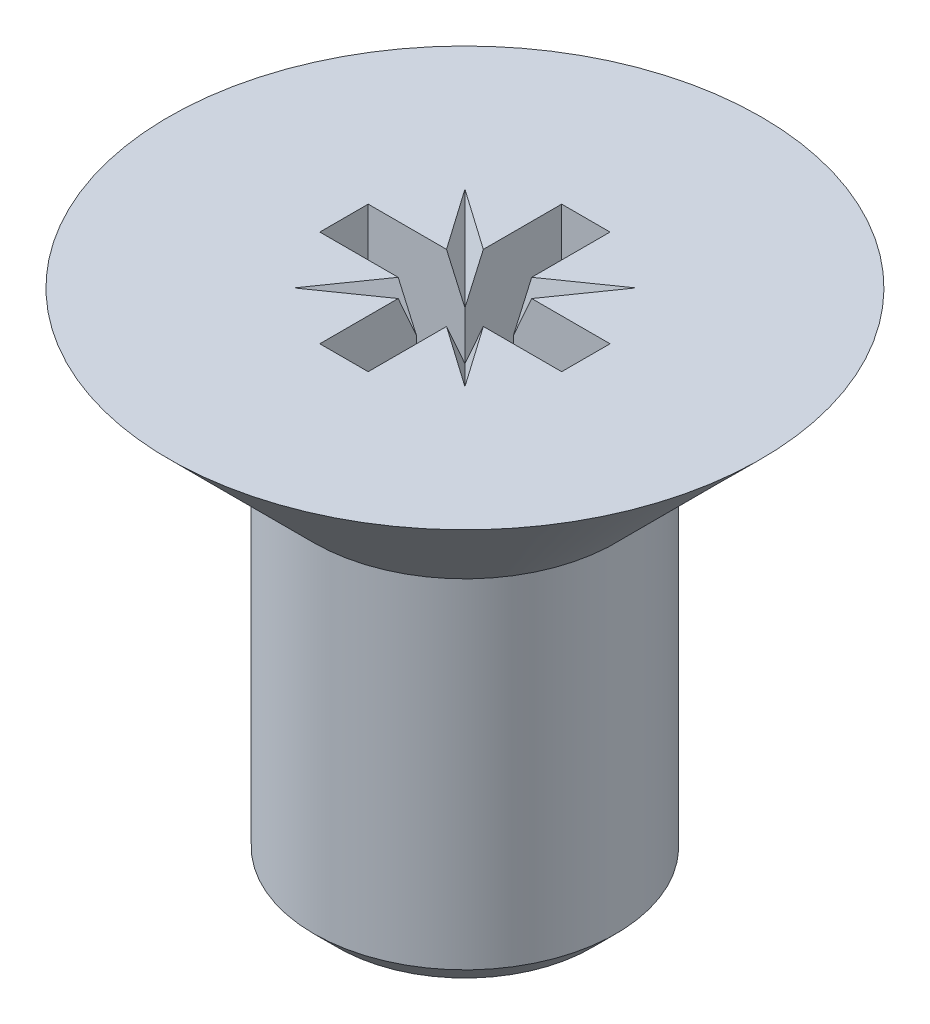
ISO-10303-21;
HEADER;
FILE_DESCRIPTION(('STEP AP214'),'2;1');
FILE_NAME('part.step','',(''),(''),'','','');
FILE_SCHEMA(('AUTOMOTIVE_DESIGN { 1 0 10303 214 1 1 1 1 }'));
ENDSEC;
DATA;
#1=APPLICATION_CONTEXT('core data for automotive mechanical design processes');
#2=APPLICATION_PROTOCOL_DEFINITION('international standard','automotive_design',2000,#1);
#3=PRODUCT_CONTEXT('',#1,'mechanical');
#4=PRODUCT('Part','Part','',(#3));
#5=PRODUCT_RELATED_PRODUCT_CATEGORY('part','',(#4));
#6=PRODUCT_DEFINITION_FORMATION('','',#4);
#7=PRODUCT_DEFINITION_CONTEXT('part definition',#1,'design');
#8=PRODUCT_DEFINITION('design','',#6,#7);
#9=PRODUCT_DEFINITION_SHAPE('','',#8);
#10=(LENGTH_UNIT() NAMED_UNIT(*) SI_UNIT(.MILLI.,.METRE.));
#11=(NAMED_UNIT(*) PLANE_ANGLE_UNIT() SI_UNIT($,.RADIAN.));
#12=(NAMED_UNIT(*) SI_UNIT($,.STERADIAN.) SOLID_ANGLE_UNIT());
#13=UNCERTAINTY_MEASURE_WITH_UNIT(LENGTH_MEASURE(1.E-05),#10,'distance_accuracy_value','');
#14=(GEOMETRIC_REPRESENTATION_CONTEXT(3) GLOBAL_UNCERTAINTY_ASSIGNED_CONTEXT((#13)) GLOBAL_UNIT_ASSIGNED_CONTEXT((#10,
#11,#12)) REPRESENTATION_CONTEXT('',''));
#15=CARTESIAN_POINT('',(0.,0.,0.));
#16=DIRECTION('',(0.,0.,1.));
#17=DIRECTION('',(1.,0.,0.));
#18=AXIS2_PLACEMENT_3D('',#15,#16,#17);
#19=CARTESIAN_POINT('',(0.,1.2,0.));
#20=DIRECTION('',(0.,1.,0.));
#21=DIRECTION('',(0.,0.,1.));
#22=AXIS2_PLACEMENT_3D('',#19,#20,#21);
#23=CONICAL_SURFACE('',#22,2.45,0.78539816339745);
#24=CARTESIAN_POINT('',(0.,0.,0.));
#25=DIRECTION('',(0.,-1.,0.));
#26=DIRECTION('',(0.,0.,-1.));
#27=AXIS2_PLACEMENT_3D('',#24,#25,#26);
#28=CIRCLE('',#27,1.25);
#29=CARTESIAN_POINT('',(0.,0.,-1.25));
#30=VERTEX_POINT('',#29);
#31=EDGE_CURVE('E311',#30,#30,#28,.T.);
#32=ORIENTED_EDGE('',*,*,#31,.F.);
#33=EDGE_LOOP('',(#32));
#34=FACE_BOUND('',#33,.T.);
#35=CARTESIAN_POINT('',(0.,1.2,0.));
#36=DIRECTION('',(0.,-1.,0.));
#37=DIRECTION('',(0.,0.,-1.));
#38=AXIS2_PLACEMENT_3D('',#35,#36,#37);
#39=CIRCLE('',#38,2.45);
#40=CARTESIAN_POINT('',(0.,1.2,-2.45));
#41=VERTEX_POINT('',#40);
#42=EDGE_CURVE('E279',#41,#41,#39,.T.);
#43=ORIENTED_EDGE('',*,*,#42,.T.);
#44=EDGE_LOOP('',(#43));
#45=FACE_BOUND('',#44,.T.);
#46=ADVANCED_FACE('F36',(#34,#45),#23,.T.);
#47=CARTESIAN_POINT('',(-2.45,1.2,0.));
#48=DIRECTION('',(0.,-1.,0.));
#49=DIRECTION('',(0.,0.,-1.));
#50=AXIS2_PLACEMENT_3D('',#47,#48,#49);
#51=PLANE('',#50);
#52=DIRECTION('',(0.,0.,1.));
#53=VECTOR('',#52,1.);
#54=CARTESIAN_POINT('',(-0.2,1.2,1.));
#55=LINE('',#54,#53);
#56=CARTESIAN_POINT('',(-0.2,1.2,0.352132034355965));
#57=VERTEX_POINT('',#56);
#58=CARTESIAN_POINT('',(-0.2,1.2,1.));
#59=VERTEX_POINT('',#58);
#60=EDGE_CURVE('E231',#57,#59,#55,.T.);
#61=ORIENTED_EDGE('',*,*,#60,.F.);
#62=DIRECTION('',(0.819231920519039,0.,-0.57346234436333));
#63=VECTOR('',#62,1.);
#64=CARTESIAN_POINT('',(-0.707106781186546,1.2,0.707106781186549));
#65=LINE('',#64,#63);
#66=CARTESIAN_POINT('',(-0.707106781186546,1.2,0.707106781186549));
#67=VERTEX_POINT('',#66);
#68=EDGE_CURVE('E174',#67,#57,#65,.T.);
#69=ORIENTED_EDGE('',*,*,#68,.F.);
#70=DIRECTION('',(-0.573462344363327,0.,0.819231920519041));
#71=VECTOR('',#70,1.);
#72=CARTESIAN_POINT('',(-0.707106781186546,1.2,0.707106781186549));
#73=LINE('',#72,#71);
#74=CARTESIAN_POINT('',(-0.352132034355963,1.2,0.2));
#75=VERTEX_POINT('',#74);
#76=EDGE_CURVE('E165',#75,#67,#73,.T.);
#77=ORIENTED_EDGE('',*,*,#76,.F.);
#78=DIRECTION('',(1.,0.,0.));
#79=VECTOR('',#78,1.);
#80=CARTESIAN_POINT('',(-0.2,1.2,0.2));
#81=LINE('',#80,#79);
#82=CARTESIAN_POINT('',(-1.,1.2,0.2));
#83=VERTEX_POINT('',#82);
#84=EDGE_CURVE('E228',#83,#75,#81,.T.);
#85=ORIENTED_EDGE('',*,*,#84,.F.);
#86=DIRECTION('',(0.,0.,1.));
#87=VECTOR('',#86,1.);
#88=CARTESIAN_POINT('',(-1.,1.2,-0.2));
#89=LINE('',#88,#87);
#90=CARTESIAN_POINT('',(-1.,1.2,-0.2));
#91=VERTEX_POINT('',#90);
#92=EDGE_CURVE('E225',#91,#83,#89,.T.);
#93=ORIENTED_EDGE('',*,*,#92,.F.);
#94=DIRECTION('',(-1.,0.,0.));
#95=VECTOR('',#94,1.);
#96=CARTESIAN_POINT('',(-0.2,1.2,-0.2));
#97=LINE('',#96,#95);
#98=CARTESIAN_POINT('',(-0.352132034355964,1.2,-0.2));
#99=VERTEX_POINT('',#98);
#100=EDGE_CURVE('E223',#99,#91,#97,.T.);
#101=ORIENTED_EDGE('',*,*,#100,.F.);
#102=DIRECTION('',(0.57346234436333,0.,0.81923192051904));
#103=VECTOR('',#102,1.);
#104=CARTESIAN_POINT('',(-0.707106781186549,1.2,-0.707106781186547));
#105=LINE('',#104,#103);
#106=CARTESIAN_POINT('',(-0.707106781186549,1.2,-0.707106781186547));
#107=VERTEX_POINT('',#106);
#108=EDGE_CURVE('E193',#107,#99,#105,.T.);
#109=ORIENTED_EDGE('',*,*,#108,.F.);
#110=DIRECTION('',(-0.819231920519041,0.,-0.573462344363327));
#111=VECTOR('',#110,1.);
#112=CARTESIAN_POINT('',(-0.707106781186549,1.2,-0.707106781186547));
#113=LINE('',#112,#111);
#114=CARTESIAN_POINT('',(-0.2,1.2,-0.352132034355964));
#115=VERTEX_POINT('',#114);
#116=EDGE_CURVE('E190',#115,#107,#113,.T.);
#117=ORIENTED_EDGE('',*,*,#116,.F.);
#118=DIRECTION('',(0.,0.,1.));
#119=VECTOR('',#118,1.);
#120=CARTESIAN_POINT('',(-0.2,1.2,-0.2));
#121=LINE('',#120,#119);
#122=CARTESIAN_POINT('',(-0.2,1.2,-1.));
#123=VERTEX_POINT('',#122);
#124=EDGE_CURVE('E220',#123,#115,#121,.T.);
#125=ORIENTED_EDGE('',*,*,#124,.F.);
#126=DIRECTION('',(-1.,0.,0.));
#127=VECTOR('',#126,1.);
#128=CARTESIAN_POINT('',(0.2,1.2,-1.));
#129=LINE('',#128,#127);
#130=CARTESIAN_POINT('',(0.2,1.2,-1.));
#131=VERTEX_POINT('',#130);
#132=EDGE_CURVE('E217',#131,#123,#129,.T.);
#133=ORIENTED_EDGE('',*,*,#132,.F.);
#134=DIRECTION('',(0.,0.,-1.));
#135=VECTOR('',#134,1.);
#136=CARTESIAN_POINT('',(0.2,1.2,-0.2));
#137=LINE('',#136,#135);
#138=CARTESIAN_POINT('',(0.2,1.2,-0.352132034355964));
#139=VERTEX_POINT('',#138);
#140=EDGE_CURVE('E215',#139,#131,#137,.T.);
#141=ORIENTED_EDGE('',*,*,#140,.F.);
#142=DIRECTION('',(-0.819231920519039,0.,0.573462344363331));
#143=VECTOR('',#142,1.);
#144=CARTESIAN_POINT('',(0.707106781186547,1.2,-0.707106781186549));
#145=LINE('',#144,#143);
#146=CARTESIAN_POINT('',(0.707106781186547,1.2,-0.707106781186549));
#147=VERTEX_POINT('',#146);
#148=EDGE_CURVE('E185',#147,#139,#145,.T.);
#149=ORIENTED_EDGE('',*,*,#148,.F.);
#150=DIRECTION('',(0.573462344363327,0.,-0.819231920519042));
#151=VECTOR('',#150,1.);
#152=CARTESIAN_POINT('',(0.707106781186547,1.2,-0.707106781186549));
#153=LINE('',#152,#151);
#154=CARTESIAN_POINT('',(0.352132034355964,1.2,-0.2));
#155=VERTEX_POINT('',#154);
#156=EDGE_CURVE('E182',#155,#147,#153,.T.);
#157=ORIENTED_EDGE('',*,*,#156,.F.);
#158=DIRECTION('',(-1.,0.,0.));
#159=VECTOR('',#158,1.);
#160=CARTESIAN_POINT('',(1.,1.2,-0.2));
#161=LINE('',#160,#159);
#162=CARTESIAN_POINT('',(1.,1.2,-0.2));
#163=VERTEX_POINT('',#162);
#164=EDGE_CURVE('E212',#163,#155,#161,.T.);
#165=ORIENTED_EDGE('',*,*,#164,.F.);
#166=DIRECTION('',(0.,0.,-1.));
#167=VECTOR('',#166,1.);
#168=CARTESIAN_POINT('',(1.,1.2,-0.2));
#169=LINE('',#168,#167);
#170=CARTESIAN_POINT('',(1.,1.2,0.2));
#171=VERTEX_POINT('',#170);
#172=EDGE_CURVE('E210',#171,#163,#169,.T.);
#173=ORIENTED_EDGE('',*,*,#172,.F.);
#174=DIRECTION('',(1.,0.,0.));
#175=VECTOR('',#174,1.);
#176=CARTESIAN_POINT('',(1.,1.2,0.2));
#177=LINE('',#176,#175);
#178=CARTESIAN_POINT('',(0.352132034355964,1.2,0.2));
#179=VERTEX_POINT('',#178);
#180=EDGE_CURVE('E181',#179,#171,#177,.T.);
#181=ORIENTED_EDGE('',*,*,#180,.F.);
#182=DIRECTION('',(-0.573462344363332,0.,-0.819231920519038));
#183=VECTOR('',#182,1.);
#184=CARTESIAN_POINT('',(0.707106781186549,1.2,0.707106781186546));
#185=LINE('',#184,#183);
#186=CARTESIAN_POINT('',(0.707106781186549,1.2,0.707106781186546));
#187=VERTEX_POINT('',#186);
#188=EDGE_CURVE('E160',#187,#179,#185,.T.);
#189=ORIENTED_EDGE('',*,*,#188,.F.);
#190=DIRECTION('',(0.819231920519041,0.,0.573462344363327));
#191=VECTOR('',#190,1.);
#192=CARTESIAN_POINT('',(0.707106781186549,1.2,0.707106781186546));
#193=LINE('',#192,#191);
#194=CARTESIAN_POINT('',(0.2,1.2,0.352132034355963));
#195=VERTEX_POINT('',#194);
#196=EDGE_CURVE('E168',#195,#187,#193,.T.);
#197=ORIENTED_EDGE('',*,*,#196,.F.);
#198=DIRECTION('',(0.,0.,-1.));
#199=VECTOR('',#198,1.);
#200=CARTESIAN_POINT('',(0.2,1.2,1.));
#201=LINE('',#200,#199);
#202=CARTESIAN_POINT('',(0.2,1.2,1.));
#203=VERTEX_POINT('',#202);
#204=EDGE_CURVE('E236',#203,#195,#201,.T.);
#205=ORIENTED_EDGE('',*,*,#204,.F.);
#206=DIRECTION('',(1.,0.,0.));
#207=VECTOR('',#206,1.);
#208=CARTESIAN_POINT('',(0.2,1.2,1.));
#209=LINE('',#208,#207);
#210=EDGE_CURVE('E233',#59,#203,#209,.T.);
#211=ORIENTED_EDGE('',*,*,#210,.F.);
#212=EDGE_LOOP('',(#61,#69,#77,#85,#93,#101,#109,#117,#125,#133,#141,#149,#157,#165,#173,#181,
#189,#197,#205,#211));
#213=FACE_BOUND('',#212,.T.);
#214=ORIENTED_EDGE('',*,*,#42,.F.);
#215=EDGE_LOOP('',(#214));
#216=FACE_BOUND('',#215,.T.);
#217=ADVANCED_FACE('F178',(#213,#216),#51,.F.);
#218=CARTESIAN_POINT('',(0.,-3.,0.));
#219=DIRECTION('',(0.,1.,0.));
#220=DIRECTION('',(0.,0.,1.));
#221=AXIS2_PLACEMENT_3D('',#218,#219,#220);
#222=CYLINDRICAL_SURFACE('',#221,1.25);
#223=CARTESIAN_POINT('',(0.,-2.8,0.));
#224=DIRECTION('',(0.,-1.,0.));
#225=DIRECTION('',(0.,0.,-1.));
#226=AXIS2_PLACEMENT_3D('',#223,#224,#225);
#227=CIRCLE('',#226,1.25);
#228=CARTESIAN_POINT('',(0.,-2.8,-1.25));
#229=VERTEX_POINT('',#228);
#230=EDGE_CURVE('E11',#229,#229,#227,.F.);
#231=ORIENTED_EDGE('',*,*,#230,.T.);
#232=EDGE_LOOP('',(#231));
#233=FACE_BOUND('',#232,.T.);
#234=ORIENTED_EDGE('',*,*,#31,.T.);
#235=EDGE_LOOP('',(#234));
#236=FACE_BOUND('',#235,.T.);
#237=ADVANCED_FACE('F343',(#233,#236),#222,.T.);
#238=CARTESIAN_POINT('',(0.,-3.,0.));
#239=DIRECTION('',(0.,-1.,0.));
#240=DIRECTION('',(0.,0.,-1.));
#241=AXIS2_PLACEMENT_3D('',#238,#239,#240);
#242=PLANE('',#241);
#243=CARTESIAN_POINT('',(0.,-3.,0.));
#244=DIRECTION('',(0.,-1.,0.));
#245=DIRECTION('',(0.,0.,-1.));
#246=AXIS2_PLACEMENT_3D('',#243,#244,#245);
#247=CIRCLE('',#246,1.05);
#248=CARTESIAN_POINT('',(0.,-3.,-1.05));
#249=VERTEX_POINT('',#248);
#250=EDGE_CURVE('E43',#249,#249,#247,.T.);
#251=ORIENTED_EDGE('',*,*,#250,.T.);
#252=EDGE_LOOP('',(#251));
#253=FACE_BOUND('',#252,.T.);
#254=ADVANCED_FACE('F326',(#253),#242,.T.);
#255=CARTESIAN_POINT('',(1.,0.4,-0.2));
#256=DIRECTION('',(1.,0.,0.));
#257=DIRECTION('',(0.,0.,-1.));
#258=AXIS2_PLACEMENT_3D('',#255,#256,#257);
#259=PLANE('',#258);
#260=ORIENTED_EDGE('',*,*,#172,.T.);
#261=DIRECTION('',(0.,1.,0.));
#262=VECTOR('',#261,1.);
#263=CARTESIAN_POINT('',(1.,0.4,-0.2));
#264=LINE('',#263,#262);
#265=CARTESIAN_POINT('',(1.,0.4,-0.2));
#266=VERTEX_POINT('',#265);
#267=EDGE_CURVE('E275',#266,#163,#264,.T.);
#268=ORIENTED_EDGE('',*,*,#267,.F.);
#269=DIRECTION('',(0.,0.,-1.));
#270=VECTOR('',#269,1.);
#271=CARTESIAN_POINT('',(1.,0.4,-0.2));
#272=LINE('',#271,#270);
#273=CARTESIAN_POINT('',(1.,0.4,0.2));
#274=VERTEX_POINT('',#273);
#275=EDGE_CURVE('E239',#274,#266,#272,.T.);
#276=ORIENTED_EDGE('',*,*,#275,.F.);
#277=DIRECTION('',(0.,1.,0.));
#278=VECTOR('',#277,1.);
#279=CARTESIAN_POINT('',(1.,0.4,0.2));
#280=LINE('',#279,#278);
#281=EDGE_CURVE('E276',#274,#171,#280,.T.);
#282=ORIENTED_EDGE('',*,*,#281,.T.);
#283=EDGE_LOOP('',(#260,#268,#276,#282));
#284=FACE_BOUND('',#283,.T.);
#285=ADVANCED_FACE('F354',(#284),#259,.F.);
#286=CARTESIAN_POINT('',(1.,0.4,0.2));
#287=DIRECTION('',(0.,0.,1.));
#288=DIRECTION('',(1.,0.,0.));
#289=AXIS2_PLACEMENT_3D('',#286,#287,#288);
#290=PLANE('',#289);
#291=DIRECTION('',(0.,1.,0.));
#292=VECTOR('',#291,1.);
#293=CARTESIAN_POINT('',(0.2,0.4,0.2));
#294=LINE('',#293,#292);
#295=CARTESIAN_POINT('',(0.2,0.4,0.2));
#296=VERTEX_POINT('',#295);
#297=CARTESIAN_POINT('',(0.2,0.857577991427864,0.2));
#298=VERTEX_POINT('',#297);
#299=EDGE_CURVE('E280',#296,#298,#294,.T.);
#300=ORIENTED_EDGE('',*,*,#299,.T.);
#301=DIRECTION('',(0.406014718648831,0.9138665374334,0.));
#302=VECTOR('',#301,1.);
#303=CARTESIAN_POINT('',(0.162097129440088,0.772265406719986,0.2));
#304=LINE('',#303,#302);
#305=EDGE_CURVE('E162',#298,#179,#304,.T.);
#306=ORIENTED_EDGE('',*,*,#305,.T.);
#307=ORIENTED_EDGE('',*,*,#180,.T.);
#308=ORIENTED_EDGE('',*,*,#281,.F.);
#309=DIRECTION('',(1.,0.,0.));
#310=VECTOR('',#309,1.);
#311=CARTESIAN_POINT('',(1.,0.4,0.2));
#312=LINE('',#311,#310);
#313=EDGE_CURVE('E272',#296,#274,#312,.T.);
#314=ORIENTED_EDGE('',*,*,#313,.F.);
#315=EDGE_LOOP('',(#300,#306,#307,#308,#314));
#316=FACE_BOUND('',#315,.T.);
#317=ADVANCED_FACE('F359',(#316),#290,.F.);
#318=CARTESIAN_POINT('',(0.2,0.4,1.));
#319=DIRECTION('',(1.,0.,0.));
#320=DIRECTION('',(0.,0.,-1.));
#321=AXIS2_PLACEMENT_3D('',#318,#319,#320);
#322=PLANE('',#321);
#323=ORIENTED_EDGE('',*,*,#204,.T.);
#324=DIRECTION('',(0.,-0.9138665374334,-0.406014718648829));
#325=VECTOR('',#324,1.);
#326=CARTESIAN_POINT('',(0.2,0.772265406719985,0.162097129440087));
#327=LINE('',#326,#325);
#328=EDGE_CURVE('E170',#195,#298,#327,.T.);
#329=ORIENTED_EDGE('',*,*,#328,.T.);
#330=ORIENTED_EDGE('',*,*,#299,.F.);
#331=DIRECTION('',(0.,0.,-1.));
#332=VECTOR('',#331,1.);
#333=CARTESIAN_POINT('',(0.2,0.4,1.));
#334=LINE('',#333,#332);
#335=CARTESIAN_POINT('',(0.2,0.4,1.));
#336=VERTEX_POINT('',#335);
#337=EDGE_CURVE('E269',#336,#296,#334,.T.);
#338=ORIENTED_EDGE('',*,*,#337,.F.);
#339=DIRECTION('',(0.,1.,0.));
#340=VECTOR('',#339,1.);
#341=CARTESIAN_POINT('',(0.2,0.4,1.));
#342=LINE('',#341,#340);
#343=EDGE_CURVE('E283',#336,#203,#342,.T.);
#344=ORIENTED_EDGE('',*,*,#343,.T.);
#345=EDGE_LOOP('',(#323,#329,#330,#338,#344));
#346=FACE_BOUND('',#345,.T.);
#347=ADVANCED_FACE('F397',(#346),#322,.F.);
#348=CARTESIAN_POINT('',(0.2,0.4,1.));
#349=DIRECTION('',(0.,0.,1.));
#350=DIRECTION('',(1.,0.,0.));
#351=AXIS2_PLACEMENT_3D('',#348,#349,#350);
#352=PLANE('',#351);
#353=ORIENTED_EDGE('',*,*,#210,.T.);
#354=ORIENTED_EDGE('',*,*,#343,.F.);
#355=DIRECTION('',(1.,0.,0.));
#356=VECTOR('',#355,1.);
#357=CARTESIAN_POINT('',(0.2,0.4,1.));
#358=LINE('',#357,#356);
#359=CARTESIAN_POINT('',(-0.2,0.4,1.));
#360=VERTEX_POINT('',#359);
#361=EDGE_CURVE('E266',#360,#336,#358,.T.);
#362=ORIENTED_EDGE('',*,*,#361,.F.);
#363=DIRECTION('',(0.,1.,0.));
#364=VECTOR('',#363,1.);
#365=CARTESIAN_POINT('',(-0.2,0.4,1.));
#366=LINE('',#365,#364);
#367=EDGE_CURVE('E285',#360,#59,#366,.T.);
#368=ORIENTED_EDGE('',*,*,#367,.T.);
#369=EDGE_LOOP('',(#353,#354,#362,#368));
#370=FACE_BOUND('',#369,.T.);
#371=ADVANCED_FACE('F393',(#370),#352,.F.);
#372=CARTESIAN_POINT('',(-0.2,0.4,1.));
#373=DIRECTION('',(-1.,0.,0.));
#374=DIRECTION('',(0.,0.,1.));
#375=AXIS2_PLACEMENT_3D('',#372,#373,#374);
#376=PLANE('',#375);
#377=DIRECTION('',(0.,1.,0.));
#378=VECTOR('',#377,1.);
#379=CARTESIAN_POINT('',(-0.2,0.4,0.2));
#380=LINE('',#379,#378);
#381=CARTESIAN_POINT('',(-0.2,0.4,0.2));
#382=VERTEX_POINT('',#381);
#383=CARTESIAN_POINT('',(-0.2,0.857577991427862,0.2));
#384=VERTEX_POINT('',#383);
#385=EDGE_CURVE('E288',#382,#384,#380,.T.);
#386=ORIENTED_EDGE('',*,*,#385,.T.);
#387=DIRECTION('',(0.,0.9138665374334,0.40601471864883));
#388=VECTOR('',#387,1.);
#389=CARTESIAN_POINT('',(-0.2,0.772265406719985,0.162097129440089));
#390=LINE('',#389,#388);
#391=EDGE_CURVE('E206',#384,#57,#390,.T.);
#392=ORIENTED_EDGE('',*,*,#391,.T.);
#393=ORIENTED_EDGE('',*,*,#60,.T.);
#394=ORIENTED_EDGE('',*,*,#367,.F.);
#395=DIRECTION('',(0.,0.,1.));
#396=VECTOR('',#395,1.);
#397=CARTESIAN_POINT('',(-0.2,0.4,1.));
#398=LINE('',#397,#396);
#399=EDGE_CURVE('E263',#382,#360,#398,.T.);
#400=ORIENTED_EDGE('',*,*,#399,.F.);
#401=EDGE_LOOP('',(#386,#392,#393,#394,#400));
#402=FACE_BOUND('',#401,.T.);
#403=ADVANCED_FACE('F389',(#402),#376,.F.);
#404=CARTESIAN_POINT('',(-0.2,0.4,0.2));
#405=DIRECTION('',(0.,0.,1.));
#406=DIRECTION('',(1.,0.,0.));
#407=AXIS2_PLACEMENT_3D('',#404,#405,#406);
#408=PLANE('',#407);
#409=ORIENTED_EDGE('',*,*,#84,.T.);
#410=DIRECTION('',(0.406014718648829,-0.9138665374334,0.));
#411=VECTOR('',#410,1.);
#412=CARTESIAN_POINT('',(-0.0302187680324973,0.475430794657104,0.2));
#413=LINE('',#412,#411);
#414=EDGE_CURVE('E320',#75,#384,#413,.T.);
#415=ORIENTED_EDGE('',*,*,#414,.T.);
#416=ORIENTED_EDGE('',*,*,#385,.F.);
#417=DIRECTION('',(1.,0.,0.));
#418=VECTOR('',#417,1.);
#419=CARTESIAN_POINT('',(-0.2,0.4,0.2));
#420=LINE('',#419,#418);
#421=CARTESIAN_POINT('',(-1.,0.4,0.2));
#422=VERTEX_POINT('',#421);
#423=EDGE_CURVE('E260',#422,#382,#420,.T.);
#424=ORIENTED_EDGE('',*,*,#423,.F.);
#425=DIRECTION('',(0.,1.,0.));
#426=VECTOR('',#425,1.);
#427=CARTESIAN_POINT('',(-1.,0.4,0.2));
#428=LINE('',#427,#426);
#429=EDGE_CURVE('E291',#422,#83,#428,.T.);
#430=ORIENTED_EDGE('',*,*,#429,.T.);
#431=EDGE_LOOP('',(#409,#415,#416,#424,#430));
#432=FACE_BOUND('',#431,.T.);
#433=ADVANCED_FACE('F385',(#432),#408,.F.);
#434=CARTESIAN_POINT('',(-1.,0.4,-0.2));
#435=DIRECTION('',(-1.,0.,0.));
#436=DIRECTION('',(0.,0.,1.));
#437=AXIS2_PLACEMENT_3D('',#434,#435,#436);
#438=PLANE('',#437);
#439=ORIENTED_EDGE('',*,*,#92,.T.);
#440=ORIENTED_EDGE('',*,*,#429,.F.);
#441=DIRECTION('',(0.,0.,1.));
#442=VECTOR('',#441,1.);
#443=CARTESIAN_POINT('',(-1.,0.4,-0.2));
#444=LINE('',#443,#442);
#445=CARTESIAN_POINT('',(-1.,0.4,-0.2));
#446=VERTEX_POINT('',#445);
#447=EDGE_CURVE('E257',#446,#422,#444,.T.);
#448=ORIENTED_EDGE('',*,*,#447,.F.);
#449=DIRECTION('',(0.,1.,0.));
#450=VECTOR('',#449,1.);
#451=CARTESIAN_POINT('',(-1.,0.4,-0.2));
#452=LINE('',#451,#450);
#453=EDGE_CURVE('E293',#446,#91,#452,.T.);
#454=ORIENTED_EDGE('',*,*,#453,.T.);
#455=EDGE_LOOP('',(#439,#440,#448,#454));
#456=FACE_BOUND('',#455,.T.);
#457=ADVANCED_FACE('F381',(#456),#438,.F.);
#458=CARTESIAN_POINT('',(-0.2,0.4,-0.2));
#459=DIRECTION('',(0.,0.,-1.));
#460=DIRECTION('',(-1.,0.,0.));
#461=AXIS2_PLACEMENT_3D('',#458,#459,#460);
#462=PLANE('',#461);
#463=DIRECTION('',(0.,1.,0.));
#464=VECTOR('',#463,1.);
#465=CARTESIAN_POINT('',(-0.2,0.4,-0.2));
#466=LINE('',#465,#464);
#467=CARTESIAN_POINT('',(-0.2,0.4,-0.2));
#468=VERTEX_POINT('',#467);
#469=CARTESIAN_POINT('',(-0.2,0.857577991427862,-0.2));
#470=VERTEX_POINT('',#469);
#471=EDGE_CURVE('E296',#468,#470,#466,.T.);
#472=ORIENTED_EDGE('',*,*,#471,.T.);
#473=DIRECTION('',(-0.40601471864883,0.9138665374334,0.));
#474=VECTOR('',#473,1.);
#475=CARTESIAN_POINT('',(-0.0302187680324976,0.475430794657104,-0.2));
#476=LINE('',#475,#474);
#477=EDGE_CURVE('E203',#470,#99,#476,.T.);
#478=ORIENTED_EDGE('',*,*,#477,.T.);
#479=ORIENTED_EDGE('',*,*,#100,.T.);
#480=ORIENTED_EDGE('',*,*,#453,.F.);
#481=DIRECTION('',(-1.,0.,0.));
#482=VECTOR('',#481,1.);
#483=CARTESIAN_POINT('',(-0.2,0.4,-0.2));
#484=LINE('',#483,#482);
#485=EDGE_CURVE('E254',#468,#446,#484,.T.);
#486=ORIENTED_EDGE('',*,*,#485,.F.);
#487=EDGE_LOOP('',(#472,#478,#479,#480,#486));
#488=FACE_BOUND('',#487,.T.);
#489=ADVANCED_FACE('F377',(#488),#462,.F.);
#490=CARTESIAN_POINT('',(-0.2,0.4,-0.2));
#491=DIRECTION('',(-1.,0.,0.));
#492=DIRECTION('',(0.,0.,1.));
#493=AXIS2_PLACEMENT_3D('',#490,#491,#492);
#494=PLANE('',#493);
#495=ORIENTED_EDGE('',*,*,#124,.T.);
#496=DIRECTION('',(0.,-0.9138665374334,0.406014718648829));
#497=VECTOR('',#496,1.);
#498=CARTESIAN_POINT('',(-0.2,0.475430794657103,-0.0302187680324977));
#499=LINE('',#498,#497);
#500=EDGE_CURVE('E317',#115,#470,#499,.T.);
#501=ORIENTED_EDGE('',*,*,#500,.T.);
#502=ORIENTED_EDGE('',*,*,#471,.F.);
#503=DIRECTION('',(0.,0.,1.));
#504=VECTOR('',#503,1.);
#505=CARTESIAN_POINT('',(-0.2,0.4,-0.2));
#506=LINE('',#505,#504);
#507=CARTESIAN_POINT('',(-0.2,0.4,-1.));
#508=VERTEX_POINT('',#507);
#509=EDGE_CURVE('E251',#508,#468,#506,.T.);
#510=ORIENTED_EDGE('',*,*,#509,.F.);
#511=DIRECTION('',(0.,1.,0.));
#512=VECTOR('',#511,1.);
#513=CARTESIAN_POINT('',(-0.2,0.4,-1.));
#514=LINE('',#513,#512);
#515=EDGE_CURVE('E299',#508,#123,#514,.T.);
#516=ORIENTED_EDGE('',*,*,#515,.T.);
#517=EDGE_LOOP('',(#495,#501,#502,#510,#516));
#518=FACE_BOUND('',#517,.T.);
#519=ADVANCED_FACE('F373',(#518),#494,.F.);
#520=CARTESIAN_POINT('',(0.2,0.4,-1.));
#521=DIRECTION('',(0.,0.,-1.));
#522=DIRECTION('',(-1.,0.,0.));
#523=AXIS2_PLACEMENT_3D('',#520,#521,#522);
#524=PLANE('',#523);
#525=ORIENTED_EDGE('',*,*,#132,.T.);
#526=ORIENTED_EDGE('',*,*,#515,.F.);
#527=DIRECTION('',(-1.,0.,0.));
#528=VECTOR('',#527,1.);
#529=CARTESIAN_POINT('',(0.2,0.4,-1.));
#530=LINE('',#529,#528);
#531=CARTESIAN_POINT('',(0.2,0.4,-1.));
#532=VERTEX_POINT('',#531);
#533=EDGE_CURVE('E248',#532,#508,#530,.T.);
#534=ORIENTED_EDGE('',*,*,#533,.F.);
#535=DIRECTION('',(0.,1.,0.));
#536=VECTOR('',#535,1.);
#537=CARTESIAN_POINT('',(0.2,0.4,-1.));
#538=LINE('',#537,#536);
#539=EDGE_CURVE('E301',#532,#131,#538,.T.);
#540=ORIENTED_EDGE('',*,*,#539,.T.);
#541=EDGE_LOOP('',(#525,#526,#534,#540));
#542=FACE_BOUND('',#541,.T.);
#543=ADVANCED_FACE('F369',(#542),#524,.F.);
#544=CARTESIAN_POINT('',(0.2,0.4,-0.2));
#545=DIRECTION('',(1.,0.,0.));
#546=DIRECTION('',(0.,0.,-1.));
#547=AXIS2_PLACEMENT_3D('',#544,#545,#546);
#548=PLANE('',#547);
#549=DIRECTION('',(0.,1.,0.));
#550=VECTOR('',#549,1.);
#551=CARTESIAN_POINT('',(0.2,0.4,-0.2));
#552=LINE('',#551,#550);
#553=CARTESIAN_POINT('',(0.2,0.4,-0.2));
#554=VERTEX_POINT('',#553);
#555=CARTESIAN_POINT('',(0.2,0.857577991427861,-0.2));
#556=VERTEX_POINT('',#555);
#557=EDGE_CURVE('E304',#554,#556,#552,.T.);
#558=ORIENTED_EDGE('',*,*,#557,.T.);
#559=DIRECTION('',(0.,0.9138665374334,-0.40601471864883));
#560=VECTOR('',#559,1.);
#561=CARTESIAN_POINT('',(0.2,0.475430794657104,-0.0302187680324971));
#562=LINE('',#561,#560);
#563=EDGE_CURVE('E196',#556,#139,#562,.T.);
#564=ORIENTED_EDGE('',*,*,#563,.T.);
#565=ORIENTED_EDGE('',*,*,#140,.T.);
#566=ORIENTED_EDGE('',*,*,#539,.F.);
#567=DIRECTION('',(0.,0.,-1.));
#568=VECTOR('',#567,1.);
#569=CARTESIAN_POINT('',(0.2,0.4,-0.2));
#570=LINE('',#569,#568);
#571=EDGE_CURVE('E245',#554,#532,#570,.T.);
#572=ORIENTED_EDGE('',*,*,#571,.F.);
#573=EDGE_LOOP('',(#558,#564,#565,#566,#572));
#574=FACE_BOUND('',#573,.T.);
#575=ADVANCED_FACE('F365',(#574),#548,.F.);
#576=CARTESIAN_POINT('',(1.,0.4,-0.2));
#577=DIRECTION('',(0.,0.,-1.));
#578=DIRECTION('',(-1.,0.,0.));
#579=AXIS2_PLACEMENT_3D('',#576,#577,#578);
#580=PLANE('',#579);
#581=ORIENTED_EDGE('',*,*,#164,.T.);
#582=DIRECTION('',(-0.406014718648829,-0.9138665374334,0.));
#583=VECTOR('',#582,1.);
#584=CARTESIAN_POINT('',(0.162097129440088,0.772265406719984,-0.2));
#585=LINE('',#584,#583);
#586=EDGE_CURVE('E314',#155,#556,#585,.T.);
#587=ORIENTED_EDGE('',*,*,#586,.T.);
#588=ORIENTED_EDGE('',*,*,#557,.F.);
#589=DIRECTION('',(-1.,0.,0.));
#590=VECTOR('',#589,1.);
#591=CARTESIAN_POINT('',(1.,0.4,-0.2));
#592=LINE('',#591,#590);
#593=EDGE_CURVE('E242',#266,#554,#592,.T.);
#594=ORIENTED_EDGE('',*,*,#593,.F.);
#595=ORIENTED_EDGE('',*,*,#267,.T.);
#596=EDGE_LOOP('',(#581,#587,#588,#594,#595));
#597=FACE_BOUND('',#596,.T.);
#598=ADVANCED_FACE('F361',(#597),#580,.F.);
#599=CARTESIAN_POINT('',(1.,0.4,1.));
#600=DIRECTION('',(0.,-1.,0.));
#601=DIRECTION('',(0.,0.,-1.));
#602=AXIS2_PLACEMENT_3D('',#599,#600,#601);
#603=PLANE('',#602);
#604=ORIENTED_EDGE('',*,*,#275,.T.);
#605=ORIENTED_EDGE('',*,*,#593,.T.);
#606=ORIENTED_EDGE('',*,*,#571,.T.);
#607=ORIENTED_EDGE('',*,*,#533,.T.);
#608=ORIENTED_EDGE('',*,*,#509,.T.);
#609=ORIENTED_EDGE('',*,*,#485,.T.);
#610=ORIENTED_EDGE('',*,*,#447,.T.);
#611=ORIENTED_EDGE('',*,*,#423,.T.);
#612=ORIENTED_EDGE('',*,*,#399,.T.);
#613=ORIENTED_EDGE('',*,*,#361,.T.);
#614=ORIENTED_EDGE('',*,*,#337,.T.);
#615=ORIENTED_EDGE('',*,*,#313,.T.);
#616=EDGE_LOOP('',(#604,#605,#606,#607,#608,#609,#610,#611,#612,#613,#614,#615));
#617=FACE_BOUND('',#616,.T.);
#618=ADVANCED_FACE('F364',(#617),#603,.F.);
#619=CARTESIAN_POINT('',(0.707106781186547,1.2,-0.707106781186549));
#620=DIRECTION('',(0.769826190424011,-0.342020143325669,0.538878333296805));
#621=DIRECTION('',(0.573462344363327,0.,-0.819231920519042));
#622=AXIS2_PLACEMENT_3D('',#619,#620,#621);
#623=PLANE('',#622);
#624=ORIENTED_EDGE('',*,*,#156,.T.);
#625=DIRECTION('',(0.638101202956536,0.430875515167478,-0.638101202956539));
#626=VECTOR('',#625,1.);
#627=CARTESIAN_POINT('',(0.707106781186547,1.2,-0.707106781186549));
#628=LINE('',#627,#626);
#629=EDGE_CURVE('E164',#556,#147,#628,.T.);
#630=ORIENTED_EDGE('',*,*,#629,.F.);
#631=ORIENTED_EDGE('',*,*,#586,.F.);
#632=EDGE_LOOP('',(#624,#630,#631));
#633=FACE_BOUND('',#632,.T.);
#634=ADVANCED_FACE('F407',(#633),#623,.F.);
#635=CARTESIAN_POINT('',(0.707106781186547,1.2,-0.707106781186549));
#636=DIRECTION('',(-0.538878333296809,-0.342020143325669,-0.769826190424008));
#637=DIRECTION('',(-0.819231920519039,0.,0.573462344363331));
#638=AXIS2_PLACEMENT_3D('',#635,#636,#637);
#639=PLANE('',#638);
#640=ORIENTED_EDGE('',*,*,#629,.T.);
#641=ORIENTED_EDGE('',*,*,#148,.T.);
#642=ORIENTED_EDGE('',*,*,#563,.F.);
#643=EDGE_LOOP('',(#640,#641,#642));
#644=FACE_BOUND('',#643,.T.);
#645=ADVANCED_FACE('F420',(#644),#639,.F.);
#646=CARTESIAN_POINT('',(-0.707106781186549,1.2,-0.707106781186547));
#647=DIRECTION('',(0.538878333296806,-0.342020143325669,-0.769826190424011));
#648=DIRECTION('',(-0.819231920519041,0.,-0.573462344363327));
#649=AXIS2_PLACEMENT_3D('',#646,#647,#648);
#650=PLANE('',#649);
#651=ORIENTED_EDGE('',*,*,#116,.T.);
#652=DIRECTION('',(-0.638101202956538,0.430875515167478,-0.638101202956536));
#653=VECTOR('',#652,1.);
#654=CARTESIAN_POINT('',(-0.707106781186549,1.2,-0.707106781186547));
#655=LINE('',#654,#653);
#656=EDGE_CURVE('E197',#470,#107,#655,.T.);
#657=ORIENTED_EDGE('',*,*,#656,.F.);
#658=ORIENTED_EDGE('',*,*,#500,.F.);
#659=EDGE_LOOP('',(#651,#657,#658));
#660=FACE_BOUND('',#659,.T.);
#661=ADVANCED_FACE('F416',(#660),#650,.F.);
#662=CARTESIAN_POINT('',(-0.707106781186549,1.2,-0.707106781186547));
#663=DIRECTION('',(-0.769826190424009,-0.342020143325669,0.538878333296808));
#664=DIRECTION('',(0.57346234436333,0.,0.819231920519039));
#665=AXIS2_PLACEMENT_3D('',#662,#663,#664);
#666=PLANE('',#665);
#667=ORIENTED_EDGE('',*,*,#656,.T.);
#668=ORIENTED_EDGE('',*,*,#108,.T.);
#669=ORIENTED_EDGE('',*,*,#477,.F.);
#670=EDGE_LOOP('',(#667,#668,#669));
#671=FACE_BOUND('',#670,.T.);
#672=ADVANCED_FACE('F413',(#671),#666,.F.);
#673=CARTESIAN_POINT('',(-0.707106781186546,1.2,0.707106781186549));
#674=DIRECTION('',(-0.769826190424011,-0.342020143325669,-0.538878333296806));
#675=DIRECTION('',(-0.573462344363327,0.,0.819231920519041));
#676=AXIS2_PLACEMENT_3D('',#673,#674,#675);
#677=PLANE('',#676);
#678=ORIENTED_EDGE('',*,*,#76,.T.);
#679=DIRECTION('',(-0.638101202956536,0.430875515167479,0.638101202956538));
#680=VECTOR('',#679,1.);
#681=CARTESIAN_POINT('',(-0.707106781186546,1.2,0.707106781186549));
#682=LINE('',#681,#680);
#683=EDGE_CURVE('E58',#384,#67,#682,.T.);
#684=ORIENTED_EDGE('',*,*,#683,.F.);
#685=ORIENTED_EDGE('',*,*,#414,.F.);
#686=EDGE_LOOP('',(#678,#684,#685));
#687=FACE_BOUND('',#686,.T.);
#688=ADVANCED_FACE('F409',(#687),#677,.F.);
#689=CARTESIAN_POINT('',(-0.707106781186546,1.2,0.707106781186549));
#690=DIRECTION('',(0.538878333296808,-0.342020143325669,0.769826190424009));
#691=DIRECTION('',(0.81923192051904,0.,-0.57346234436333));
#692=AXIS2_PLACEMENT_3D('',#689,#690,#691);
#693=PLANE('',#692);
#694=ORIENTED_EDGE('',*,*,#683,.T.);
#695=ORIENTED_EDGE('',*,*,#68,.T.);
#696=ORIENTED_EDGE('',*,*,#391,.F.);
#697=EDGE_LOOP('',(#694,#695,#696));
#698=FACE_BOUND('',#697,.T.);
#699=ADVANCED_FACE('F412',(#698),#693,.F.);
#700=CARTESIAN_POINT('',(0.707106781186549,1.2,0.707106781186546));
#701=DIRECTION('',(0.769826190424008,-0.342020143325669,-0.53887833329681));
#702=DIRECTION('',(-0.573462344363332,0.,-0.819231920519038));
#703=AXIS2_PLACEMENT_3D('',#700,#701,#702);
#704=PLANE('',#703);
#705=DIRECTION('',(0.63810120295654,0.430875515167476,0.638101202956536));
#706=VECTOR('',#705,1.);
#707=CARTESIAN_POINT('',(0.707106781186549,1.2,0.707106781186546));
#708=LINE('',#707,#706);
#709=EDGE_CURVE('E50',#298,#187,#708,.T.);
#710=ORIENTED_EDGE('',*,*,#709,.T.);
#711=ORIENTED_EDGE('',*,*,#188,.T.);
#712=ORIENTED_EDGE('',*,*,#305,.F.);
#713=EDGE_LOOP('',(#710,#711,#712));
#714=FACE_BOUND('',#713,.T.);
#715=ADVANCED_FACE('F158',(#714),#704,.F.);
#716=CARTESIAN_POINT('',(0.707106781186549,1.2,0.707106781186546));
#717=DIRECTION('',(-0.538878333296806,-0.342020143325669,0.769826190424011));
#718=DIRECTION('',(0.819231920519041,0.,0.573462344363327));
#719=AXIS2_PLACEMENT_3D('',#716,#717,#718);
#720=PLANE('',#719);
#721=ORIENTED_EDGE('',*,*,#196,.T.);
#722=ORIENTED_EDGE('',*,*,#709,.F.);
#723=ORIENTED_EDGE('',*,*,#328,.F.);
#724=EDGE_LOOP('',(#721,#722,#723));
#725=FACE_BOUND('',#724,.T.);
#726=ADVANCED_FACE('F169',(#725),#720,.F.);
#727=CARTESIAN_POINT('',(0.,-3.,0.));
#728=DIRECTION('',(0.,1.,0.));
#729=DIRECTION('',(0.,0.,1.));
#730=AXIS2_PLACEMENT_3D('',#727,#728,#729);
#731=CONICAL_SURFACE('',#730,1.05,0.785398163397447);
#732=ORIENTED_EDGE('',*,*,#230,.F.);
#733=EDGE_LOOP('',(#732));
#734=FACE_BOUND('',#733,.T.);
#735=ORIENTED_EDGE('',*,*,#250,.F.);
#736=EDGE_LOOP('',(#735));
#737=FACE_BOUND('',#736,.T.);
#738=ADVANCED_FACE('F328',(#734,#737),#731,.T.);
#739=CLOSED_SHELL('',(#46,#217,#237,#254,#285,#317,#347,#371,#403,#433,#457,#489,#519,#543,#575,
#598,#618,#634,#645,#661,#672,#688,#699,#715,#726,#738));
#740=MANIFOLD_SOLID_BREP('B2',#739);
#741=ADVANCED_BREP_SHAPE_REPRESENTATION('',(#18,#740),#14);
#742=SHAPE_DEFINITION_REPRESENTATION(#9,#741);
ENDSEC;
END-ISO-10303-21;
